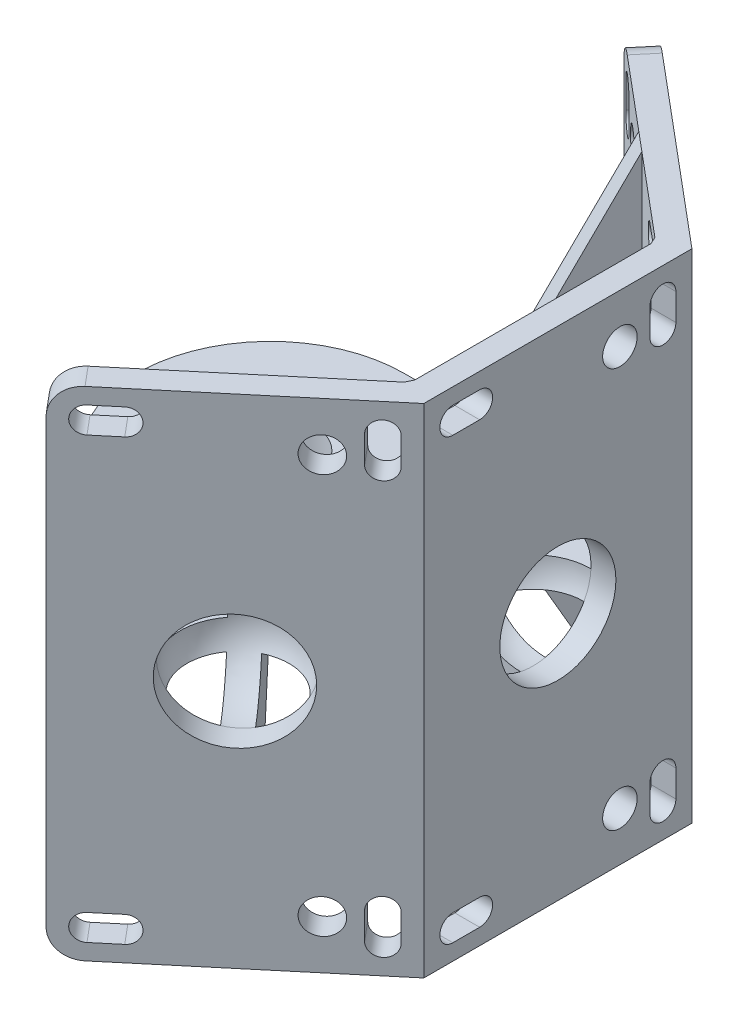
from build123d import *

# Parameters (mm, degrees)
SKETCH1_R            = 4.0005
SKETCH1_R_2          = 1.1938
BASE_DEPTH           = 2.286
COVER_DEPTH          = 25.4
BASE_CLOSE_DEPTH     = 2.286
BOSS_EXTRUDE5_DEPTH  = 20.32
SKETCH7_R            = 5.334
SKETCH7_R_2          = 1.5875
CUT_EXTRUDE1_DEPTH   = 2.286
SKETCH19_R           = 5.334
SKETCH19_R_2         = 1.5875
CUT_EXTRUDE10_DEPTH  = 2.286
SKETCH21_R           = 1.5875
SKETCH21_R_2         = 5.334
CUT_EXTRUDE12_DEPTH  = 2.286
SKETCH23_W           = 11.43
SKETCH23_H           = 2.286
BOSS_EXTRUDE7_DEPTH  = 20.32
SKETCH28_W           = 11.43
SKETCH28_H           = 2.286
BOSS_EXTRUDE8_DEPTH  = 23.114
CUT_EXTRUDE19_DEPTH  = 2.286
CUT_EXTRUDE21_DEPTH  = 2.286
CUT_EXTRUDE22_DEPTH  = 2.286
CUT_EXTRUDE23_DEPTH  = 2.286
CUT_EXTRUDE24_DEPTH  = 2.286
CUT_EXTRUDE25_DEPTH  = 2.286
FILLET1_R            = 2.54
FILLET2_R            = 2.54
FILLET3_R            = 2.54
FILLET4_R            = 2.54
BOSS_EXTRUDE9_DEPTH  = 45.72
BOSS_EXTRUDE10_DEPTH = 45.72


with BuildPart() as part:
    # Sketch1 → base (new body)
    with BuildSketch(Plane(origin=(0, 0, 0), x_dir=(1, 0, 0), z_dir=(0, 1, 0))):
        with BuildLine():
            Line((0, 12.2936), (18.1864, 12.2936))
            Line((18.1864, 12.2936), (18.1864, -12.2936))
            Line((18.1864, -12.2936), (0, -12.2936))
            ThreePointArc((0, -12.2936), (-12.2936, 0), (0, 12.2936))
        make_face()
        with Locations(Location((0, 0, 0), (0, 0, 270))):
            Circle(SKETCH1_R, mode=Mode.SUBTRACT)
        with Locations(Location((0, 8.3312, 0), (0, 0, 270))):
            Circle(SKETCH1_R_2, mode=Mode.SUBTRACT)
        with Locations(Location((-8.3312, 0, 0), (0, 0, 270))):
            Circle(SKETCH1_R_2, mode=Mode.SUBTRACT)
        with Locations(Location((0, -8.3312, 0), (0, 0, 270))):
            Circle(SKETCH1_R_2, mode=Mode.SUBTRACT)
        with Locations(Location((8.3312, 0, 0), (0, 0, 270))):
            Circle(SKETCH1_R_2, mode=Mode.SUBTRACT)
    extrude(amount=BASE_DEPTH)



with BuildPart() as body_2:
    # Sketch3 → cover (new body)
    with BuildSketch(Plane(origin=(0, 0, 0), x_dir=(1, 0, 0), z_dir=(0, 1, 0))):
        Polygon((7.544377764, 28.156001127), (6.074965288, 26.40482353), (24.132180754, 11.253020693), (24.132180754, -11.253020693), (6.074965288, -26.40482353), (7.544377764, -28.156001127), (26.418180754, -12.319), (26.418180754, 12.319), align=None)
    extrude(amount=COVER_DEPTH)


with BuildPart() as part_1:
    add(part.part)

    add(body_2.part)  # base close merges body 2
    # Sketch4 → base close (add)
    with BuildSketch(Plane.XZ):
        Polygon((6.074965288, -26.40482353), (6.074965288, -12.2936), (18.1864, -12.2936), (18.1864, 12.2936), (6.074965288, 12.2936), (6.074965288, 26.40482353), (24.132180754, 11.253020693), (24.132180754, -11.253020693), align=None)
    extrude(amount=-BASE_CLOSE_DEPTH)

    # Sketch6 → Boss-Extrude5 (add)
    with BuildSketch(Plane.XZ):
        Polygon((7.544377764, 28.156001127), (26.418180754, 12.319), (26.418180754, -12.319), (7.544377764, -28.156001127), (6.074965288, -26.40482353), (24.132180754, -11.253020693), (24.132180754, 11.253020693), (6.074965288, 26.40482353), align=None)
    extrude(amount=BOSS_EXTRUDE5_DEPTH)

    # Sketch7 → Cut-Extrude1 (cut)
    with BuildSketch(Plane(origin=(26.418180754, 0, 0), x_dir=(0, 0, -1), z_dir=(1, 0, 0))):
        with Locations((0, 2.54)):
            Circle(SKETCH7_R)
        with Locations((5.7023, 20.9169)):
            Circle(SKETCH7_R_2)
        with Locations((5.7023, -15.8369)):
            Circle(SKETCH7_R_2)
        with BuildLine():
            Line((8.4582, 22.733), (8.4582, 20.2692))
            ThreePointArc((8.4582, 20.2692), (9.652, 19.0754), (10.8458, 20.2692))
            Line((10.8458, 20.2692), (10.8458, 22.733))
            ThreePointArc((10.8458, 22.733), (9.652, 23.9268), (8.4582, 22.733))
        make_face()
        with BuildLine():
            Line((-9.652, 23.9268), (-7.1882, 23.9268))
            ThreePointArc((-7.1882, 23.9268), (-5.9944, 22.733), (-7.1882, 21.5392))
            Line((-7.1882, 21.5392), (-9.652, 21.5392))
            ThreePointArc((-9.652, 21.5392), (-10.8458, 22.733), (-9.652, 23.9268))
        make_face()
        with BuildLine():
            Line((-9.652, -16.4592), (-7.1882, -16.4592))
            ThreePointArc((-7.1882, -16.4592), (-5.9944, -17.653), (-7.1882, -18.8468))
            Line((-7.1882, -18.8468), (-9.652, -18.8468))
            ThreePointArc((-9.652, -18.8468), (-10.8458, -17.653), (-9.652, -16.4592))
        make_face()
        with BuildLine():
            Line((8.4582, -15.1892), (8.4582, -17.653))
            ThreePointArc((8.4582, -17.653), (9.652, -18.8468), (10.8458, -17.653))
            Line((10.8458, -17.653), (10.8458, -15.1892))
            ThreePointArc((10.8458, -15.1892), (9.652, -13.9954), (8.4582, -15.1892))
        make_face()
    extrude(amount=-CUT_EXTRUDE1_DEPTH, mode=Mode.SUBTRACT)

    # Sketch19 → Cut-Extrude10 (cut)
    with BuildSketch(Plane(origin=(16.981279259, 0, -20.237500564), x_dir=(-0.7660444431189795, 0, -0.6427876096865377), z_dir=(0.6427876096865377, 0, -0.7660444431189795))):
        with Locations((0, 2.54)):
            Circle(SKETCH19_R)
        with Locations((5.7023, 20.9169)):
            Circle(SKETCH19_R_2)
        with Locations((5.7023, -15.8369)):
            Circle(SKETCH19_R_2)
        with BuildLine():
            Line((-9.652, 23.9268), (-7.1882, 23.9268))
            ThreePointArc((-7.1882, 23.9268), (-5.9944, 22.733), (-7.1882, 21.5392))
            Line((-7.1882, 21.5392), (-9.652, 21.5392))
            ThreePointArc((-9.652, 21.5392), (-10.8458, 22.733), (-9.652, 23.9268))
        make_face()
        with BuildLine():
            Line((10.8458, 22.733), (10.8458, 20.2692))
            ThreePointArc((10.8458, 20.2692), (9.652, 19.0754), (8.4582, 20.2692))
            Line((8.4582, 20.2692), (8.4582, 22.733))
            ThreePointArc((8.4582, 22.733), (9.652, 23.9268), (10.8458, 22.733))
        make_face()
        with BuildLine():
            Line((8.4582, -15.1892), (8.4582, -17.653))
            ThreePointArc((8.4582, -17.653), (9.652, -18.8468), (10.8458, -17.653))
            Line((10.8458, -17.653), (10.8458, -15.1892))
            ThreePointArc((10.8458, -15.1892), (9.652, -13.9954), (8.4582, -15.1892))
        make_face()
        with BuildLine():
            Line((-9.652, -16.4592), (-7.1882, -16.4592))
            ThreePointArc((-7.1882, -16.4592), (-5.9944, -17.653), (-7.1882, -18.8468))
            Line((-7.1882, -18.8468), (-9.652, -18.8468))
            ThreePointArc((-9.652, -18.8468), (-10.8458, -17.653), (-9.652, -16.4592))
        make_face()
    extrude(amount=-CUT_EXTRUDE10_DEPTH, mode=Mode.SUBTRACT)

    # Sketch21 → Cut-Extrude12 (cut)
    with BuildSketch(Plane(origin=(16.981279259, 0, 20.237500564), x_dir=(0.7660444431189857, 0, -0.6427876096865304), z_dir=(0.6427876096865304, 0, 0.7660444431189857))):
        with Locations((5.7023, 20.9169)):
            Circle(SKETCH21_R)
        with Locations((5.7023, -15.8369)):
            Circle(SKETCH21_R)
        with Locations((0, 2.54)):
            Circle(SKETCH21_R_2)
        with BuildLine():
            Line((-9.652, 23.9268), (-7.1882, 23.9268))
            ThreePointArc((-7.1882, 23.9268), (-5.9944, 22.733), (-7.1882, 21.5392))
            Line((-7.1882, 21.5392), (-9.652, 21.5392))
            ThreePointArc((-9.652, 21.5392), (-10.8458, 22.733), (-9.652, 23.9268))
        make_face()
        with BuildLine():
            Line((8.4582, 22.733), (8.4582, 20.2692))
            ThreePointArc((8.4582, 20.2692), (9.652, 19.0754), (10.8458, 20.2692))
            Line((10.8458, 20.2692), (10.8458, 22.733))
            ThreePointArc((10.8458, 22.733), (9.652, 23.9268), (8.4582, 22.733))
        make_face()
        with BuildLine():
            Line((8.4582, -15.1892), (8.4582, -17.653))
            ThreePointArc((8.4582, -17.653), (9.652, -18.8468), (10.8458, -17.653))
            Line((10.8458, -17.653), (10.8458, -15.1892))
            ThreePointArc((10.8458, -15.1892), (9.652, -13.9954), (8.4582, -15.1892))
        make_face()
        with BuildLine():
            Line((-9.652, -18.8468), (-7.1882, -18.8468))
            ThreePointArc((-7.1882, -18.8468), (-5.9944, -17.653), (-7.1882, -16.4592))
            Line((-7.1882, -16.4592), (-9.652, -16.4592))
            ThreePointArc((-9.652, -16.4592), (-10.8458, -17.653), (-9.652, -18.8468))
        make_face()
    extrude(amount=-CUT_EXTRUDE12_DEPTH, mode=Mode.SUBTRACT)

    # Sketch23 → Boss-Extrude7 (add)
    with BuildSketch(Plane.XZ):
        Polygon((16.387455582, 17.751616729), (14.636277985, 19.221029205), (7.289215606, 10.46514122), (9.040393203, 8.995728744), align=None)
        with Locations((18.417180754, 0)):
            Rectangle(SKETCH23_W, SKETCH23_H)
        Polygon((14.636277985, -19.221029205), (16.387455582, -17.751616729), (9.040393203, -8.995728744), (7.289215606, -10.46514122), align=None)
    extrude(amount=BOSS_EXTRUDE7_DEPTH)

    # Sketch28 → Boss-Extrude8 (add)
    with BuildSketch(Plane(origin=(0, 2.286, 0), x_dir=(1, 0, 0), z_dir=(0, 1, 0))):
        Polygon((16.387455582, 17.751616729), (14.636277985, 19.221029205), (7.289215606, 10.46514122), (9.040393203, 8.995728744), align=None)
        with Locations((18.417180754, 0)):
            Rectangle(SKETCH28_W, SKETCH28_H)
        Polygon((14.636277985, -19.221029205), (16.387455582, -17.751616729), (9.040393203, -8.995728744), (7.289215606, -10.46514122), align=None)
    extrude(amount=BOSS_EXTRUDE8_DEPTH)

    # Sketch29 → Cut-Extrude19 (cut)
    with BuildSketch(Plane(origin=(-0.875588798, 0, 0.734706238), x_dir=(0.6427876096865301, 0, 0.7660444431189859), z_dir=(-0.7660444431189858, 0, 0.64278760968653))):
        Polygon((24.132180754, 25.4), (12.702180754, 2.286), (12.702180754, 25.4), align=None)
    extrude(amount=-CUT_EXTRUDE19_DEPTH, mode=Mode.SUBTRACT)

    # Sketch31 → Cut-Extrude21 (cut)
    with BuildSketch(Plane.XY.offset(1.143)):
        Polygon((24.132180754, 25.4), (12.702180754, 2.286), (12.702180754, 25.4), align=None)
    extrude(amount=-CUT_EXTRUDE21_DEPTH, mode=Mode.SUBTRACT)

    # Sketch32 → Cut-Extrude22 (cut)
    with BuildSketch(Plane(origin=(0.875588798, 0, 0.734706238), x_dir=(0.6427876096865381, 0, -0.7660444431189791), z_dir=(0.7660444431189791, 0, 0.6427876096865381))):
        Polygon((12.702180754, 2.286), (24.132180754, 25.4), (12.702180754, 25.4), align=None)
    extrude(amount=-CUT_EXTRUDE22_DEPTH, mode=Mode.SUBTRACT)

    # Sketch33 → Cut-Extrude23 (cut)
    with BuildSketch(Plane(origin=(-0.875588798, 0, -0.734706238), x_dir=(-0.6427876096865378, 0, 0.7660444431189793), z_dir=(-0.7660444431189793, 0, -0.6427876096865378))):
        Polygon((-12.702180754, 0), (-24.132180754, -20.32), (-12.702180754, -20.32), align=None)
    extrude(amount=-CUT_EXTRUDE23_DEPTH, mode=Mode.SUBTRACT)

    # Sketch34 → Cut-Extrude24 (cut)
    with BuildSketch(Plane(origin=(0, 0, -1.143), x_dir=(-1, 0, 0), z_dir=(0, 0, -1))):
        Polygon((-12.702180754, 0), (-24.132180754, -20.32), (-12.702180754, -20.32), align=None)
    extrude(amount=-CUT_EXTRUDE24_DEPTH, mode=Mode.SUBTRACT)

    # Sketch35 → Cut-Extrude25 (cut)
    with BuildSketch(Plane(origin=(0.875588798, 0, -0.734706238), x_dir=(-0.6427876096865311, 0, -0.766044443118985), z_dir=(0.766044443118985, 0, -0.6427876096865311))):
        Polygon((-12.702180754, 0), (-24.132180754, -20.32), (-12.702180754, -20.32), align=None)
    extrude(amount=-CUT_EXTRUDE25_DEPTH, mode=Mode.SUBTRACT)

    # Sketch37 → Cut-Revolve2 (revolve, cut)
    with BuildSketch(Plane(origin=(24.132180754, 0, 0), x_dir=(0, 0, -1), z_dir=(1, 0, 0))):
        with BuildLine():
            Line((0, 7.874), (0, -2.794))
            ThreePointArc((0, -2.794), (5.334, 2.54), (0, 7.874))
        make_face()
    revolve(axis=Axis((24.132180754, 7.874, 0), (0, -1, 0)), mode=Mode.SUBTRACT)

    # Sketch38 → Cut-Revolve3 (revolve, cut)
    with BuildSketch(Plane(origin=(15.511866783, 0, 18.486322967), x_dir=(0.7660444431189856, 0, -0.6427876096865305), z_dir=(0.6427876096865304, 0, 0.7660444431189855))):
        with BuildLine():
            Line((0, 7.874), (0, -2.794))
            ThreePointArc((0, -2.794), (5.334, 2.54), (0, 7.874))
        make_face()
    revolve(axis=Axis((15.511866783, 7.874, 18.486322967), (0, -1, 0)), mode=Mode.SUBTRACT)

    # Sketch39 → Cut-Revolve4 (revolve, cut)
    with BuildSketch(Plane(origin=(15.511866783, 0, -18.486322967), x_dir=(-0.7660444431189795, 0, -0.6427876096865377), z_dir=(0.6427876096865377, 0, -0.7660444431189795))):
        with BuildLine():
            Line((0, 7.874), (0, -2.794))
            ThreePointArc((0, -2.794), (5.334, 2.54), (0, 7.874))
        make_face()
    revolve(axis=Axis((15.511866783, 7.874, -18.486322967), (0, -1, 0)), mode=Mode.SUBTRACT)

    # Fillet1
    fillet1_edges = [part_1.edges().sort_by_distance(p)[0] for p in [
        (6.809671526, 25.4, 27.280412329),
    ]]
    fillet(fillet1_edges, radius=FILLET1_R)

    # Fillet2
    fillet2_edges = [part_1.edges().sort_by_distance(p)[0] for p in [
        (6.809671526, 25.4, -27.280412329),
    ]]
    fillet(fillet2_edges, radius=FILLET2_R)

    # Fillet3
    fillet3_edges = [part_1.edges().sort_by_distance(p)[0] for p in [
        (6.809671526, -20.32, -27.280412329),
    ]]
    fillet(fillet3_edges, radius=FILLET3_R)

    # Fillet4
    fillet4_edges = [part_1.edges().sort_by_distance(p)[0] for p in [
        (6.809671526, -20.32, 27.280412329),
    ]]
    fillet(fillet4_edges, radius=FILLET4_R)

    # Sketch42 → Boss-Extrude9 (add)
    with BuildSketch(Plane(origin=(0, 25.4, 0), x_dir=(1, 0, 0), z_dir=(0, 1, 0))):
        Polygon((23.820860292, 11.514249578), (24.132180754, 11.253020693), (24.132180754, 10.846620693), align=None)
    extrude(amount=-BOSS_EXTRUDE9_DEPTH)

    # Sketch43 → Boss-Extrude10 (add)
    with BuildSketch(Plane(origin=(0, 25.4, 0), x_dir=(1, 0, 0), z_dir=(0, 1, 0))):
        Polygon((23.820860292, -11.514249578), (24.132180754, -11.253020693), (24.132180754, -10.846620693), align=None)
    extrude(amount=-BOSS_EXTRUDE10_DEPTH)


solid = part_1.part
